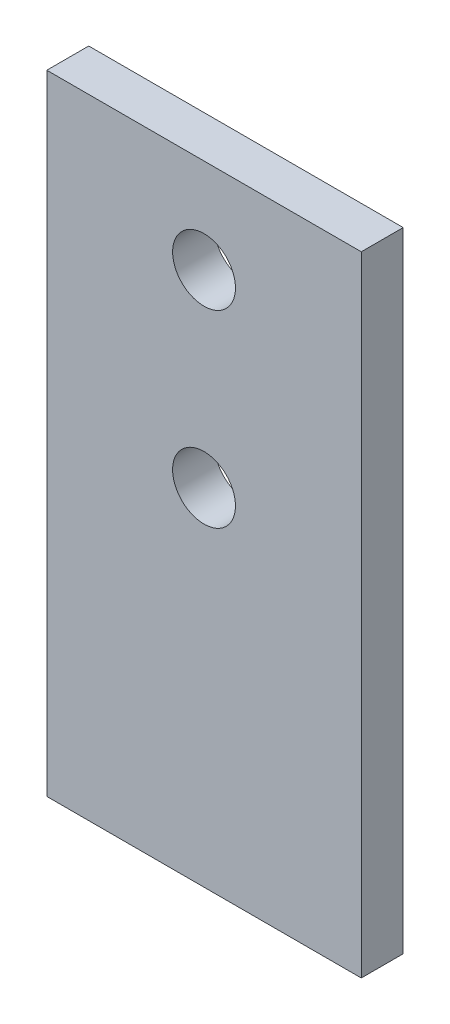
ISO-10303-21;
HEADER;
FILE_DESCRIPTION(('STEP AP214'),'2;1');
FILE_NAME('part.step','',(''),(''),'','','');
FILE_SCHEMA(('AUTOMOTIVE_DESIGN { 1 0 10303 214 1 1 1 1 }'));
ENDSEC;
DATA;
#1=APPLICATION_CONTEXT('core data for automotive mechanical design processes');
#2=APPLICATION_PROTOCOL_DEFINITION('international standard','automotive_design',2000,#1);
#3=PRODUCT_CONTEXT('',#1,'mechanical');
#4=PRODUCT('Part','Part','',(#3));
#5=PRODUCT_RELATED_PRODUCT_CATEGORY('part','',(#4));
#6=PRODUCT_DEFINITION_FORMATION('','',#4);
#7=PRODUCT_DEFINITION_CONTEXT('part definition',#1,'design');
#8=PRODUCT_DEFINITION('design','',#6,#7);
#9=PRODUCT_DEFINITION_SHAPE('','',#8);
#10=(LENGTH_UNIT() NAMED_UNIT(*) SI_UNIT(.MILLI.,.METRE.));
#11=(NAMED_UNIT(*) PLANE_ANGLE_UNIT() SI_UNIT($,.RADIAN.));
#12=(NAMED_UNIT(*) SI_UNIT($,.STERADIAN.) SOLID_ANGLE_UNIT());
#13=UNCERTAINTY_MEASURE_WITH_UNIT(LENGTH_MEASURE(1.E-05),#10,'distance_accuracy_value','');
#14=(GEOMETRIC_REPRESENTATION_CONTEXT(3) GLOBAL_UNCERTAINTY_ASSIGNED_CONTEXT((#13)) GLOBAL_UNIT_ASSIGNED_CONTEXT((#10,
#11,#12)) REPRESENTATION_CONTEXT('',''));
#15=CARTESIAN_POINT('',(0.,0.,0.));
#16=DIRECTION('',(0.,0.,1.));
#17=DIRECTION('',(1.,0.,0.));
#18=AXIS2_PLACEMENT_3D('',#15,#16,#17);
#19=CARTESIAN_POINT('',(26.55000405,22.8002935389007,3.54000054));
#20=DIRECTION('',(1.,0.,0.));
#21=DIRECTION('',(0.,0.,-1.));
#22=AXIS2_PLACEMENT_3D('',#19,#20,#21);
#23=PLANE('',#22);
#24=DIRECTION('',(0.,1.,0.));
#25=VECTOR('',#24,1.);
#26=CARTESIAN_POINT('',(26.55000405,37.8003016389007,3.54000054));
#27=LINE('',#26,#25);
#28=CARTESIAN_POINT('',(26.55000405,22.8002935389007,3.54000054));
#29=VERTEX_POINT('',#28);
#30=CARTESIAN_POINT('',(26.55000405,52.8003097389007,3.54000054));
#31=VERTEX_POINT('',#30);
#32=EDGE_CURVE('E88',#29,#31,#27,.T.);
#33=ORIENTED_EDGE('',*,*,#32,.F.);
#34=DIRECTION('',(0.,0.,1.));
#35=VECTOR('',#34,1.);
#36=CARTESIAN_POINT('',(26.55000405,22.8002935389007,2.54));
#37=LINE('',#36,#35);
#38=CARTESIAN_POINT('',(26.55000405,22.8002935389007,1.53999946));
#39=VERTEX_POINT('',#38);
#40=EDGE_CURVE('E76',#39,#29,#37,.T.);
#41=ORIENTED_EDGE('',*,*,#40,.F.);
#42=DIRECTION('',(0.,1.,0.));
#43=VECTOR('',#42,1.);
#44=CARTESIAN_POINT('',(26.55000405,37.8003016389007,1.53999946));
#45=LINE('',#44,#43);
#46=CARTESIAN_POINT('',(26.55000405,52.8003097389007,1.53999946));
#47=VERTEX_POINT('',#46);
#48=EDGE_CURVE('E114',#39,#47,#45,.T.);
#49=ORIENTED_EDGE('',*,*,#48,.T.);
#50=DIRECTION('',(0.,0.,-1.));
#51=VECTOR('',#50,1.);
#52=CARTESIAN_POINT('',(26.55000405,52.8003097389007,2.54));
#53=LINE('',#52,#51);
#54=EDGE_CURVE('E92',#31,#47,#53,.T.);
#55=ORIENTED_EDGE('',*,*,#54,.F.);
#56=EDGE_LOOP('',(#33,#41,#49,#55));
#57=FACE_BOUND('',#56,.T.);
#58=ADVANCED_FACE('F34',(#57),#23,.T.);
#59=CARTESIAN_POINT('',(11.54999595,52.8003097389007,1.53999946));
#60=DIRECTION('',(0.,1.,0.));
#61=DIRECTION('',(0.,0.,1.));
#62=AXIS2_PLACEMENT_3D('',#59,#60,#61);
#63=PLANE('',#62);
#64=DIRECTION('',(-1.,0.,0.));
#65=VECTOR('',#64,1.);
#66=CARTESIAN_POINT('',(19.05,52.8003097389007,3.54000054));
#67=LINE('',#66,#65);
#68=CARTESIAN_POINT('',(11.54999595,52.8003097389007,3.54000054));
#69=VERTEX_POINT('',#68);
#70=EDGE_CURVE('E94',#31,#69,#67,.T.);
#71=ORIENTED_EDGE('',*,*,#70,.F.);
#72=ORIENTED_EDGE('',*,*,#54,.T.);
#73=DIRECTION('',(-1.,0.,0.));
#74=VECTOR('',#73,1.);
#75=CARTESIAN_POINT('',(19.05,52.8003097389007,1.53999946));
#76=LINE('',#75,#74);
#77=CARTESIAN_POINT('',(11.54999595,52.8003097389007,1.53999946));
#78=VERTEX_POINT('',#77);
#79=EDGE_CURVE('E109',#47,#78,#76,.T.);
#80=ORIENTED_EDGE('',*,*,#79,.T.);
#81=DIRECTION('',(0.,0.,-1.));
#82=VECTOR('',#81,1.);
#83=CARTESIAN_POINT('',(11.54999595,52.8003097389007,2.54));
#84=LINE('',#83,#82);
#85=EDGE_CURVE('E84',#69,#78,#84,.T.);
#86=ORIENTED_EDGE('',*,*,#85,.F.);
#87=EDGE_LOOP('',(#71,#72,#80,#86));
#88=FACE_BOUND('',#87,.T.);
#89=ADVANCED_FACE('F147',(#88),#63,.T.);
#90=CARTESIAN_POINT('',(11.54999595,22.8002935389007,1.53999946));
#91=DIRECTION('',(-1.,0.,0.));
#92=DIRECTION('',(0.,0.,1.));
#93=AXIS2_PLACEMENT_3D('',#90,#91,#92);
#94=PLANE('',#93);
#95=DIRECTION('',(0.,-1.,0.));
#96=VECTOR('',#95,1.);
#97=CARTESIAN_POINT('',(11.54999595,37.8003016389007,3.54000054));
#98=LINE('',#97,#96);
#99=CARTESIAN_POINT('',(11.54999595,22.8002935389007,3.54000054));
#100=VERTEX_POINT('',#99);
#101=EDGE_CURVE('E90',#69,#100,#98,.T.);
#102=ORIENTED_EDGE('',*,*,#101,.F.);
#103=ORIENTED_EDGE('',*,*,#85,.T.);
#104=DIRECTION('',(0.,-1.,0.));
#105=VECTOR('',#104,1.);
#106=CARTESIAN_POINT('',(11.54999595,37.8003016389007,1.53999946));
#107=LINE('',#106,#105);
#108=CARTESIAN_POINT('',(11.54999595,22.8002935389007,1.53999946));
#109=VERTEX_POINT('',#108);
#110=EDGE_CURVE('E107',#78,#109,#107,.T.);
#111=ORIENTED_EDGE('',*,*,#110,.T.);
#112=DIRECTION('',(0.,0.,-1.));
#113=VECTOR('',#112,1.);
#114=CARTESIAN_POINT('',(11.54999595,22.8002935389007,2.54));
#115=LINE('',#114,#113);
#116=EDGE_CURVE('E53',#100,#109,#115,.T.);
#117=ORIENTED_EDGE('',*,*,#116,.F.);
#118=EDGE_LOOP('',(#102,#103,#111,#117));
#119=FACE_BOUND('',#118,.T.);
#120=ADVANCED_FACE('F127',(#119),#94,.T.);
#121=CARTESIAN_POINT('',(11.54999595,22.8002935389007,3.54000054));
#122=DIRECTION('',(0.,-1.,0.));
#123=DIRECTION('',(0.,0.,-1.));
#124=AXIS2_PLACEMENT_3D('',#121,#122,#123);
#125=PLANE('',#124);
#126=DIRECTION('',(1.,0.,0.));
#127=VECTOR('',#126,1.);
#128=CARTESIAN_POINT('',(19.05,22.8002935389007,3.54000054));
#129=LINE('',#128,#127);
#130=EDGE_CURVE('E79',#100,#29,#129,.T.);
#131=ORIENTED_EDGE('',*,*,#130,.F.);
#132=ORIENTED_EDGE('',*,*,#116,.T.);
#133=DIRECTION('',(1.,0.,0.));
#134=VECTOR('',#133,1.);
#135=CARTESIAN_POINT('',(19.05,22.8002935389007,1.53999946));
#136=LINE('',#135,#134);
#137=EDGE_CURVE('E80',#109,#39,#136,.T.);
#138=ORIENTED_EDGE('',*,*,#137,.T.);
#139=ORIENTED_EDGE('',*,*,#40,.T.);
#140=EDGE_LOOP('',(#131,#132,#138,#139));
#141=FACE_BOUND('',#140,.T.);
#142=ADVANCED_FACE('F78',(#141),#125,.T.);
#143=CARTESIAN_POINT('',(19.05,48.3003073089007,3.54000054));
#144=DIRECTION('',(0.,0.,-1.));
#145=DIRECTION('',(-1.,0.,0.));
#146=AXIS2_PLACEMENT_3D('',#143,#144,#145);
#147=CYLINDRICAL_SURFACE('',#146,1.50000081);
#148=CARTESIAN_POINT('',(19.05,48.3003073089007,1.53999946));
#149=DIRECTION('',(0.,0.,-1.));
#150=DIRECTION('',(-1.,0.,0.));
#151=AXIS2_PLACEMENT_3D('',#148,#149,#150);
#152=CIRCLE('',#151,1.50000081);
#153=CARTESIAN_POINT('',(17.54999919,48.3003073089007,1.53999946));
#154=VERTEX_POINT('',#153);
#155=EDGE_CURVE('E103',#154,#154,#152,.T.);
#156=ORIENTED_EDGE('',*,*,#155,.T.);
#157=EDGE_LOOP('',(#156));
#158=FACE_BOUND('',#157,.T.);
#159=CARTESIAN_POINT('',(19.05,48.3003073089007,3.54000054));
#160=DIRECTION('',(0.,0.,-1.));
#161=DIRECTION('',(-1.,0.,0.));
#162=AXIS2_PLACEMENT_3D('',#159,#160,#161);
#163=CIRCLE('',#162,1.50000081);
#164=CARTESIAN_POINT('',(17.54999919,48.3003073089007,3.54000054));
#165=VERTEX_POINT('',#164);
#166=EDGE_CURVE('E38',#165,#165,#163,.T.);
#167=ORIENTED_EDGE('',*,*,#166,.F.);
#168=EDGE_LOOP('',(#167));
#169=FACE_BOUND('',#168,.T.);
#170=ADVANCED_FACE('F120',(#158,#169),#147,.F.);
#171=CARTESIAN_POINT('',(11.54999595,22.8002935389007,3.54000054));
#172=DIRECTION('',(0.,0.,1.));
#173=DIRECTION('',(1.,0.,0.));
#174=AXIS2_PLACEMENT_3D('',#171,#172,#173);
#175=PLANE('',#174);
#176=ORIENTED_EDGE('',*,*,#166,.T.);
#177=EDGE_LOOP('',(#176));
#178=FACE_BOUND('',#177,.T.);
#179=CARTESIAN_POINT('',(19.05,39.3003024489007,3.54000054));
#180=DIRECTION('',(0.,0.,-1.));
#181=DIRECTION('',(-1.,0.,0.));
#182=AXIS2_PLACEMENT_3D('',#179,#180,#181);
#183=CIRCLE('',#182,1.50000081);
#184=CARTESIAN_POINT('',(17.54999919,39.3003024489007,3.54000054));
#185=VERTEX_POINT('',#184);
#186=EDGE_CURVE('E44',#185,#185,#183,.F.);
#187=ORIENTED_EDGE('',*,*,#186,.F.);
#188=EDGE_LOOP('',(#187));
#189=FACE_BOUND('',#188,.T.);
#190=ORIENTED_EDGE('',*,*,#70,.T.);
#191=ORIENTED_EDGE('',*,*,#101,.T.);
#192=ORIENTED_EDGE('',*,*,#130,.T.);
#193=ORIENTED_EDGE('',*,*,#32,.T.);
#194=EDGE_LOOP('',(#190,#191,#192,#193));
#195=FACE_BOUND('',#194,.T.);
#196=ADVANCED_FACE('F87',(#178,#189,#195),#175,.T.);
#197=CARTESIAN_POINT('',(11.54999595,22.8002935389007,1.53999946));
#198=DIRECTION('',(0.,0.,1.));
#199=DIRECTION('',(1.,0.,0.));
#200=AXIS2_PLACEMENT_3D('',#197,#198,#199);
#201=PLANE('',#200);
#202=ORIENTED_EDGE('',*,*,#155,.F.);
#203=EDGE_LOOP('',(#202));
#204=FACE_BOUND('',#203,.T.);
#205=CARTESIAN_POINT('',(19.05,39.3003024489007,1.53999946));
#206=DIRECTION('',(0.,0.,-1.));
#207=DIRECTION('',(-1.,0.,0.));
#208=AXIS2_PLACEMENT_3D('',#205,#206,#207);
#209=CIRCLE('',#208,1.50000081);
#210=CARTESIAN_POINT('',(17.54999919,39.3003024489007,1.53999946));
#211=VERTEX_POINT('',#210);
#212=EDGE_CURVE('E11',#211,#211,#209,.T.);
#213=ORIENTED_EDGE('',*,*,#212,.F.);
#214=EDGE_LOOP('',(#213));
#215=FACE_BOUND('',#214,.T.);
#216=ORIENTED_EDGE('',*,*,#110,.F.);
#217=ORIENTED_EDGE('',*,*,#79,.F.);
#218=ORIENTED_EDGE('',*,*,#48,.F.);
#219=ORIENTED_EDGE('',*,*,#137,.F.);
#220=EDGE_LOOP('',(#216,#217,#218,#219));
#221=FACE_BOUND('',#220,.T.);
#222=ADVANCED_FACE('F36',(#204,#215,#221),#201,.F.);
#223=CARTESIAN_POINT('',(19.05,39.3003024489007,3.54000054));
#224=DIRECTION('',(0.,0.,-1.));
#225=DIRECTION('',(-1.,0.,0.));
#226=AXIS2_PLACEMENT_3D('',#223,#224,#225);
#227=CYLINDRICAL_SURFACE('',#226,1.50000081);
#228=ORIENTED_EDGE('',*,*,#212,.T.);
#229=EDGE_LOOP('',(#228));
#230=FACE_BOUND('',#229,.T.);
#231=ORIENTED_EDGE('',*,*,#186,.T.);
#232=EDGE_LOOP('',(#231));
#233=FACE_BOUND('',#232,.T.);
#234=ADVANCED_FACE('F131',(#230,#233),#227,.F.);
#235=CLOSED_SHELL('',(#58,#89,#120,#142,#170,#196,#222,#234));
#236=MANIFOLD_SOLID_BREP('B2',#235);
#237=ADVANCED_BREP_SHAPE_REPRESENTATION('',(#18,#236),#14);
#238=SHAPE_DEFINITION_REPRESENTATION(#9,#237);
ENDSEC;
END-ISO-10303-21;
